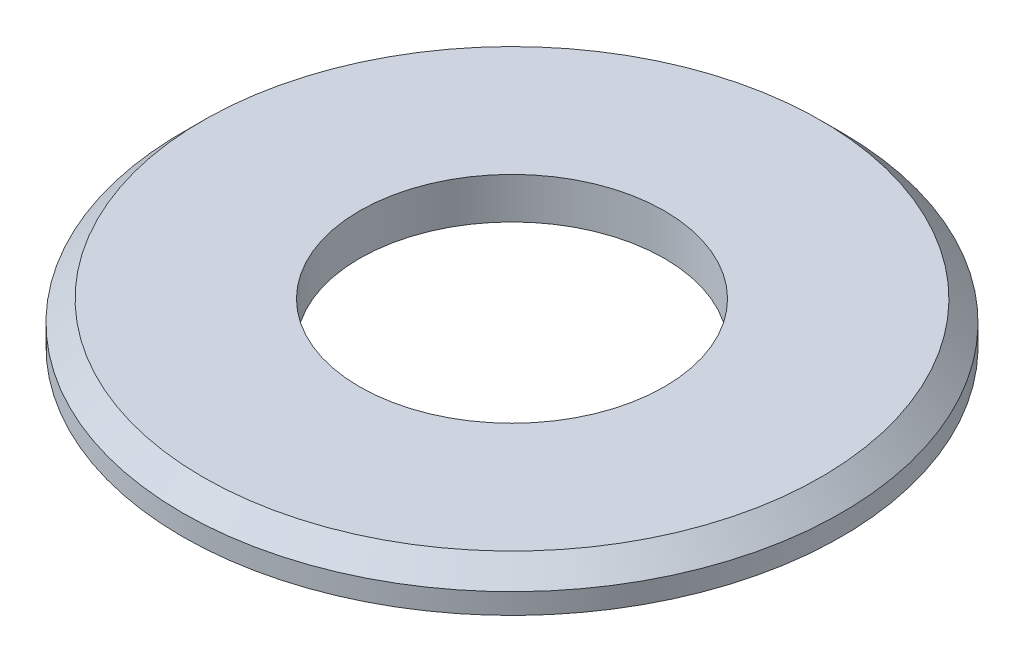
from build123d import *

# Parameters (mm, degrees)
SKETCH1_R      = 4
SKETCH1_R_2    = 1.85
EXTRUDE1_DEPTH = 0.5
CHAMFER1_SIZE  = 0.25


with BuildPart() as part:
    # Sketch1 → Extrude1 (new body)
    with BuildSketch(Plane(origin=(0, 0, 0), x_dir=(1, 0, 0), z_dir=(0, 1, 0))):
        with Locations(Location((0, 0, 0), (0, 0, 270))):
            Circle(SKETCH1_R)
        with Locations(Location((0, 0, 0), (0, 0, 270))):
            Circle(SKETCH1_R_2, mode=Mode.SUBTRACT)
    extrude(amount=EXTRUDE1_DEPTH)

    # Chamfer1
    chamfer1_edges = [part.edges().sort_by_distance(p)[0] for p in [
        (0, 0.5, -4),
    ]]
    chamfer(chamfer1_edges, length=CHAMFER1_SIZE)


solid = part.part
